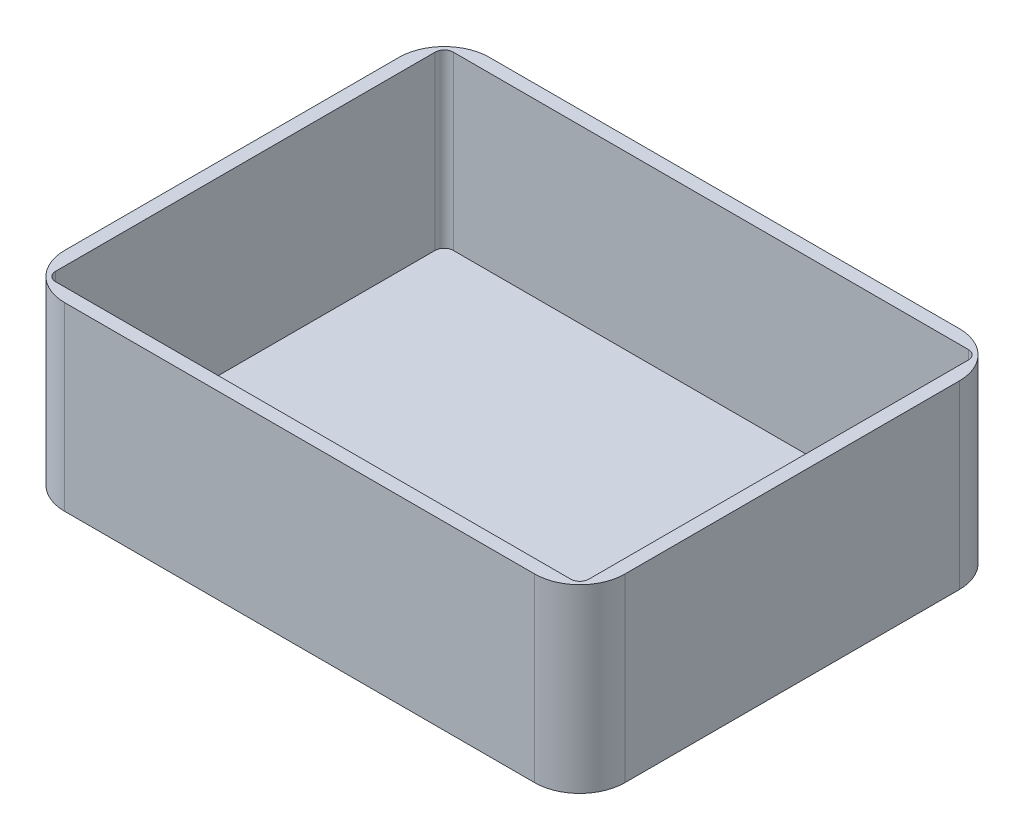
ISO-10303-21;
HEADER;
FILE_DESCRIPTION(('STEP AP214'),'2;1');
FILE_NAME('part.step','',(''),(''),'','','');
FILE_SCHEMA(('AUTOMOTIVE_DESIGN { 1 0 10303 214 1 1 1 1 }'));
ENDSEC;
DATA;
#1=APPLICATION_CONTEXT('core data for automotive mechanical design processes');
#2=APPLICATION_PROTOCOL_DEFINITION('international standard','automotive_design',2000,#1);
#3=PRODUCT_CONTEXT('',#1,'mechanical');
#4=PRODUCT('Part','Part','',(#3));
#5=PRODUCT_RELATED_PRODUCT_CATEGORY('part','',(#4));
#6=PRODUCT_DEFINITION_FORMATION('','',#4);
#7=PRODUCT_DEFINITION_CONTEXT('part definition',#1,'design');
#8=PRODUCT_DEFINITION('design','',#6,#7);
#9=PRODUCT_DEFINITION_SHAPE('','',#8);
#10=(LENGTH_UNIT() NAMED_UNIT(*) SI_UNIT(.MILLI.,.METRE.));
#11=(NAMED_UNIT(*) PLANE_ANGLE_UNIT() SI_UNIT($,.RADIAN.));
#12=(NAMED_UNIT(*) SI_UNIT($,.STERADIAN.) SOLID_ANGLE_UNIT());
#13=UNCERTAINTY_MEASURE_WITH_UNIT(LENGTH_MEASURE(1.E-05),#10,'distance_accuracy_value','');
#14=(GEOMETRIC_REPRESENTATION_CONTEXT(3) GLOBAL_UNCERTAINTY_ASSIGNED_CONTEXT((#13)) GLOBAL_UNIT_ASSIGNED_CONTEXT((#10,
#11,#12)) REPRESENTATION_CONTEXT('',''));
#15=CARTESIAN_POINT('',(0.,0.,0.));
#16=DIRECTION('',(0.,0.,1.));
#17=DIRECTION('',(1.,0.,0.));
#18=AXIS2_PLACEMENT_3D('',#15,#16,#17);
#19=CARTESIAN_POINT('',(62.,40.,-47.));
#20=DIRECTION('',(-1.,0.,0.));
#21=DIRECTION('',(0.,0.,1.));
#22=AXIS2_PLACEMENT_3D('',#19,#20,#21);
#23=PLANE('',#22);
#24=DIRECTION('',(0.,0.,-1.));
#25=VECTOR('',#24,1.);
#26=CARTESIAN_POINT('',(62.,0.,-47.));
#27=LINE('',#26,#25);
#28=CARTESIAN_POINT('',(62.,0.,37.));
#29=VERTEX_POINT('',#28);
#30=CARTESIAN_POINT('',(62.,0.,-37.));
#31=VERTEX_POINT('',#30);
#32=EDGE_CURVE('E182',#29,#31,#27,.T.);
#33=ORIENTED_EDGE('',*,*,#32,.T.);
#34=DIRECTION('',(0.,-1.,0.));
#35=VECTOR('',#34,1.);
#36=CARTESIAN_POINT('',(62.,40.,-37.));
#37=LINE('',#36,#35);
#38=CARTESIAN_POINT('',(62.,40.,-37.));
#39=VERTEX_POINT('',#38);
#40=EDGE_CURVE('E206',#31,#39,#37,.F.);
#41=ORIENTED_EDGE('',*,*,#40,.T.);
#42=DIRECTION('',(0.,0.,-1.));
#43=VECTOR('',#42,1.);
#44=CARTESIAN_POINT('',(62.,40.,-47.));
#45=LINE('',#44,#43);
#46=CARTESIAN_POINT('',(62.,40.,37.));
#47=VERTEX_POINT('',#46);
#48=EDGE_CURVE('E180',#47,#39,#45,.T.);
#49=ORIENTED_EDGE('',*,*,#48,.F.);
#50=DIRECTION('',(0.,-1.,0.));
#51=VECTOR('',#50,1.);
#52=CARTESIAN_POINT('',(62.,40.,37.));
#53=LINE('',#52,#51);
#54=EDGE_CURVE('E203',#47,#29,#53,.T.);
#55=ORIENTED_EDGE('',*,*,#54,.T.);
#56=EDGE_LOOP('',(#33,#41,#49,#55));
#57=FACE_BOUND('',#56,.T.);
#58=ADVANCED_FACE('F38',(#57),#23,.F.);
#59=CARTESIAN_POINT('',(-62.,40.,-47.));
#60=DIRECTION('',(0.,0.,1.));
#61=DIRECTION('',(1.,0.,0.));
#62=AXIS2_PLACEMENT_3D('',#59,#60,#61);
#63=PLANE('',#62);
#64=DIRECTION('',(-1.,0.,0.));
#65=VECTOR('',#64,1.);
#66=CARTESIAN_POINT('',(-62.,0.,-47.));
#67=LINE('',#66,#65);
#68=CARTESIAN_POINT('',(52.,0.,-47.));
#69=VERTEX_POINT('',#68);
#70=CARTESIAN_POINT('',(-52.,0.,-47.));
#71=VERTEX_POINT('',#70);
#72=EDGE_CURVE('E177',#69,#71,#67,.T.);
#73=ORIENTED_EDGE('',*,*,#72,.T.);
#74=DIRECTION('',(0.,-1.,0.));
#75=VECTOR('',#74,1.);
#76=CARTESIAN_POINT('',(-52.,40.,-47.));
#77=LINE('',#76,#75);
#78=CARTESIAN_POINT('',(-52.,40.,-47.));
#79=VERTEX_POINT('',#78);
#80=EDGE_CURVE('E155',#71,#79,#77,.F.);
#81=ORIENTED_EDGE('',*,*,#80,.T.);
#82=DIRECTION('',(-1.,0.,0.));
#83=VECTOR('',#82,1.);
#84=CARTESIAN_POINT('',(-62.,40.,-47.));
#85=LINE('',#84,#83);
#86=CARTESIAN_POINT('',(52.,40.,-47.));
#87=VERTEX_POINT('',#86);
#88=EDGE_CURVE('E285',#87,#79,#85,.T.);
#89=ORIENTED_EDGE('',*,*,#88,.F.);
#90=DIRECTION('',(0.,-1.,0.));
#91=VECTOR('',#90,1.);
#92=CARTESIAN_POINT('',(52.,40.,-47.));
#93=LINE('',#92,#91);
#94=EDGE_CURVE('E160',#87,#69,#93,.T.);
#95=ORIENTED_EDGE('',*,*,#94,.T.);
#96=EDGE_LOOP('',(#73,#81,#89,#95));
#97=FACE_BOUND('',#96,.T.);
#98=ADVANCED_FACE('F302',(#97),#63,.F.);
#99=CARTESIAN_POINT('',(-62.,40.,-47.));
#100=DIRECTION('',(1.,0.,0.));
#101=DIRECTION('',(0.,0.,-1.));
#102=AXIS2_PLACEMENT_3D('',#99,#100,#101);
#103=PLANE('',#102);
#104=DIRECTION('',(0.,0.,1.));
#105=VECTOR('',#104,1.);
#106=CARTESIAN_POINT('',(-62.,40.,-47.));
#107=LINE('',#106,#105);
#108=CARTESIAN_POINT('',(-62.,40.,-37.));
#109=VERTEX_POINT('',#108);
#110=CARTESIAN_POINT('',(-62.,40.,37.));
#111=VERTEX_POINT('',#110);
#112=EDGE_CURVE('E170',#109,#111,#107,.T.);
#113=ORIENTED_EDGE('',*,*,#112,.F.);
#114=DIRECTION('',(0.,-1.,0.));
#115=VECTOR('',#114,1.);
#116=CARTESIAN_POINT('',(-62.,40.,-37.));
#117=LINE('',#116,#115);
#118=CARTESIAN_POINT('',(-62.,0.,-37.));
#119=VERTEX_POINT('',#118);
#120=EDGE_CURVE('E154',#109,#119,#117,.T.);
#121=ORIENTED_EDGE('',*,*,#120,.T.);
#122=DIRECTION('',(0.,0.,1.));
#123=VECTOR('',#122,1.);
#124=CARTESIAN_POINT('',(-62.,0.,-47.));
#125=LINE('',#124,#123);
#126=CARTESIAN_POINT('',(-62.,0.,37.));
#127=VERTEX_POINT('',#126);
#128=EDGE_CURVE('E167',#119,#127,#125,.T.);
#129=ORIENTED_EDGE('',*,*,#128,.T.);
#130=DIRECTION('',(0.,-1.,0.));
#131=VECTOR('',#130,1.);
#132=CARTESIAN_POINT('',(-62.,40.,37.));
#133=LINE('',#132,#131);
#134=EDGE_CURVE('E172',#127,#111,#133,.F.);
#135=ORIENTED_EDGE('',*,*,#134,.T.);
#136=EDGE_LOOP('',(#113,#121,#129,#135));
#137=FACE_BOUND('',#136,.T.);
#138=ADVANCED_FACE('F166',(#137),#103,.F.);
#139=CARTESIAN_POINT('',(-62.,40.,47.));
#140=DIRECTION('',(0.,0.,-1.));
#141=DIRECTION('',(-1.,0.,0.));
#142=AXIS2_PLACEMENT_3D('',#139,#140,#141);
#143=PLANE('',#142);
#144=DIRECTION('',(1.,0.,0.));
#145=VECTOR('',#144,1.);
#146=CARTESIAN_POINT('',(-62.,0.,47.));
#147=LINE('',#146,#145);
#148=CARTESIAN_POINT('',(-52.,0.,47.));
#149=VERTEX_POINT('',#148);
#150=CARTESIAN_POINT('',(52.,0.,47.));
#151=VERTEX_POINT('',#150);
#152=EDGE_CURVE('E176',#149,#151,#147,.T.);
#153=ORIENTED_EDGE('',*,*,#152,.T.);
#154=DIRECTION('',(0.,-1.,0.));
#155=VECTOR('',#154,1.);
#156=CARTESIAN_POINT('',(52.,40.,47.));
#157=LINE('',#156,#155);
#158=CARTESIAN_POINT('',(52.,40.,47.));
#159=VERTEX_POINT('',#158);
#160=EDGE_CURVE('E211',#151,#159,#157,.F.);
#161=ORIENTED_EDGE('',*,*,#160,.T.);
#162=DIRECTION('',(1.,0.,0.));
#163=VECTOR('',#162,1.);
#164=CARTESIAN_POINT('',(-62.,40.,47.));
#165=LINE('',#164,#163);
#166=CARTESIAN_POINT('',(-52.,40.,47.));
#167=VERTEX_POINT('',#166);
#168=EDGE_CURVE('E186',#167,#159,#165,.T.);
#169=ORIENTED_EDGE('',*,*,#168,.F.);
#170=DIRECTION('',(0.,-1.,0.));
#171=VECTOR('',#170,1.);
#172=CARTESIAN_POINT('',(-52.,40.,47.));
#173=LINE('',#172,#171);
#174=EDGE_CURVE('E208',#167,#149,#173,.T.);
#175=ORIENTED_EDGE('',*,*,#174,.T.);
#176=EDGE_LOOP('',(#153,#161,#169,#175));
#177=FACE_BOUND('',#176,.T.);
#178=ADVANCED_FACE('F309',(#177),#143,.F.);
#179=CARTESIAN_POINT('',(0.,40.,0.));
#180=DIRECTION('',(0.,1.,0.));
#181=DIRECTION('',(0.,0.,1.));
#182=AXIS2_PLACEMENT_3D('',#179,#180,#181);
#183=PLANE('',#182);
#184=DIRECTION('',(0.,0.,-1.));
#185=VECTOR('',#184,1.);
#186=CARTESIAN_POINT('',(59.,40.,-44.));
#187=LINE('',#186,#185);
#188=CARTESIAN_POINT('',(59.,40.,42.));
#189=VERTEX_POINT('',#188);
#190=CARTESIAN_POINT('',(59.,40.,-42.));
#191=VERTEX_POINT('',#190);
#192=EDGE_CURVE('E248',#189,#191,#187,.T.);
#193=ORIENTED_EDGE('',*,*,#192,.F.);
#194=CARTESIAN_POINT('',(57.,40.,42.));
#195=DIRECTION('',(0.,1.,0.));
#196=DIRECTION('',(0.,0.,1.));
#197=AXIS2_PLACEMENT_3D('',#194,#195,#196);
#198=CIRCLE('',#197,2.);
#199=CARTESIAN_POINT('',(57.,40.,44.));
#200=VERTEX_POINT('',#199);
#201=EDGE_CURVE('E46',#189,#200,#198,.F.);
#202=ORIENTED_EDGE('',*,*,#201,.T.);
#203=DIRECTION('',(1.,0.,0.));
#204=VECTOR('',#203,1.);
#205=CARTESIAN_POINT('',(-59.,40.,44.));
#206=LINE('',#205,#204);
#207=CARTESIAN_POINT('',(-57.,40.,44.));
#208=VERTEX_POINT('',#207);
#209=EDGE_CURVE('E247',#208,#200,#206,.T.);
#210=ORIENTED_EDGE('',*,*,#209,.F.);
#211=CARTESIAN_POINT('',(-57.,40.,42.));
#212=DIRECTION('',(0.,1.,0.));
#213=DIRECTION('',(0.,0.,1.));
#214=AXIS2_PLACEMENT_3D('',#211,#212,#213);
#215=CIRCLE('',#214,2.);
#216=CARTESIAN_POINT('',(-59.,40.,42.));
#217=VERTEX_POINT('',#216);
#218=EDGE_CURVE('E242',#208,#217,#215,.F.);
#219=ORIENTED_EDGE('',*,*,#218,.T.);
#220=DIRECTION('',(0.,0.,1.));
#221=VECTOR('',#220,1.);
#222=CARTESIAN_POINT('',(-59.,40.,-44.));
#223=LINE('',#222,#221);
#224=CARTESIAN_POINT('',(-59.,40.,-42.));
#225=VERTEX_POINT('',#224);
#226=EDGE_CURVE('E255',#225,#217,#223,.T.);
#227=ORIENTED_EDGE('',*,*,#226,.F.);
#228=CARTESIAN_POINT('',(-57.,40.,-42.));
#229=DIRECTION('',(0.,1.,0.));
#230=DIRECTION('',(0.,0.,1.));
#231=AXIS2_PLACEMENT_3D('',#228,#229,#230);
#232=CIRCLE('',#231,2.);
#233=CARTESIAN_POINT('',(-57.,40.,-44.));
#234=VERTEX_POINT('',#233);
#235=EDGE_CURVE('E240',#225,#234,#232,.F.);
#236=ORIENTED_EDGE('',*,*,#235,.T.);
#237=DIRECTION('',(-1.,0.,0.));
#238=VECTOR('',#237,1.);
#239=CARTESIAN_POINT('',(-59.,40.,-44.));
#240=LINE('',#239,#238);
#241=CARTESIAN_POINT('',(57.,40.,-44.));
#242=VERTEX_POINT('',#241);
#243=EDGE_CURVE('E278',#242,#234,#240,.T.);
#244=ORIENTED_EDGE('',*,*,#243,.F.);
#245=CARTESIAN_POINT('',(57.,40.,-42.));
#246=DIRECTION('',(0.,1.,0.));
#247=DIRECTION('',(0.,0.,1.));
#248=AXIS2_PLACEMENT_3D('',#245,#246,#247);
#249=CIRCLE('',#248,2.);
#250=EDGE_CURVE('E11',#242,#191,#249,.F.);
#251=ORIENTED_EDGE('',*,*,#250,.T.);
#252=EDGE_LOOP('',(#193,#202,#210,#219,#227,#236,#244,#251));
#253=FACE_BOUND('',#252,.T.);
#254=ORIENTED_EDGE('',*,*,#88,.T.);
#255=CARTESIAN_POINT('',(-52.,40.,-37.));
#256=DIRECTION('',(0.,1.,0.));
#257=DIRECTION('',(0.,0.,1.));
#258=AXIS2_PLACEMENT_3D('',#255,#256,#257);
#259=CIRCLE('',#258,10.);
#260=EDGE_CURVE('E201',#79,#109,#259,.T.);
#261=ORIENTED_EDGE('',*,*,#260,.T.);
#262=ORIENTED_EDGE('',*,*,#112,.T.);
#263=CARTESIAN_POINT('',(-52.,40.,37.));
#264=DIRECTION('',(0.,1.,0.));
#265=DIRECTION('',(0.,0.,1.));
#266=AXIS2_PLACEMENT_3D('',#263,#264,#265);
#267=CIRCLE('',#266,10.);
#268=EDGE_CURVE('E195',#111,#167,#267,.T.);
#269=ORIENTED_EDGE('',*,*,#268,.T.);
#270=ORIENTED_EDGE('',*,*,#168,.T.);
#271=CARTESIAN_POINT('',(52.,40.,37.));
#272=DIRECTION('',(0.,1.,0.));
#273=DIRECTION('',(0.,0.,1.));
#274=AXIS2_PLACEMENT_3D('',#271,#272,#273);
#275=CIRCLE('',#274,10.);
#276=EDGE_CURVE('E197',#159,#47,#275,.T.);
#277=ORIENTED_EDGE('',*,*,#276,.T.);
#278=ORIENTED_EDGE('',*,*,#48,.T.);
#279=CARTESIAN_POINT('',(52.,40.,-37.));
#280=DIRECTION('',(0.,1.,0.));
#281=DIRECTION('',(0.,0.,1.));
#282=AXIS2_PLACEMENT_3D('',#279,#280,#281);
#283=CIRCLE('',#282,10.);
#284=EDGE_CURVE('E199',#39,#87,#283,.T.);
#285=ORIENTED_EDGE('',*,*,#284,.T.);
#286=EDGE_LOOP('',(#254,#261,#262,#269,#270,#277,#278,#285));
#287=FACE_BOUND('',#286,.T.);
#288=ADVANCED_FACE('F245',(#253,#287),#183,.T.);
#289=CARTESIAN_POINT('',(0.,0.,0.));
#290=DIRECTION('',(0.,1.,0.));
#291=DIRECTION('',(0.,0.,1.));
#292=AXIS2_PLACEMENT_3D('',#289,#290,#291);
#293=PLANE('',#292);
#294=ORIENTED_EDGE('',*,*,#128,.F.);
#295=CARTESIAN_POINT('',(-52.,0.,-37.));
#296=DIRECTION('',(0.,1.,0.));
#297=DIRECTION('',(0.,0.,1.));
#298=AXIS2_PLACEMENT_3D('',#295,#296,#297);
#299=CIRCLE('',#298,10.);
#300=EDGE_CURVE('E150',#119,#71,#299,.F.);
#301=ORIENTED_EDGE('',*,*,#300,.T.);
#302=ORIENTED_EDGE('',*,*,#72,.F.);
#303=CARTESIAN_POINT('',(52.,0.,-37.));
#304=DIRECTION('',(0.,1.,0.));
#305=DIRECTION('',(0.,0.,1.));
#306=AXIS2_PLACEMENT_3D('',#303,#304,#305);
#307=CIRCLE('',#306,10.);
#308=EDGE_CURVE('E161',#69,#31,#307,.F.);
#309=ORIENTED_EDGE('',*,*,#308,.T.);
#310=ORIENTED_EDGE('',*,*,#32,.F.);
#311=CARTESIAN_POINT('',(52.,0.,37.));
#312=DIRECTION('',(0.,1.,0.));
#313=DIRECTION('',(0.,0.,1.));
#314=AXIS2_PLACEMENT_3D('',#311,#312,#313);
#315=CIRCLE('',#314,10.);
#316=EDGE_CURVE('E189',#29,#151,#315,.F.);
#317=ORIENTED_EDGE('',*,*,#316,.T.);
#318=ORIENTED_EDGE('',*,*,#152,.F.);
#319=CARTESIAN_POINT('',(-52.,0.,37.));
#320=DIRECTION('',(0.,1.,0.));
#321=DIRECTION('',(0.,0.,1.));
#322=AXIS2_PLACEMENT_3D('',#319,#320,#321);
#323=CIRCLE('',#322,10.);
#324=EDGE_CURVE('E171',#149,#127,#323,.F.);
#325=ORIENTED_EDGE('',*,*,#324,.T.);
#326=EDGE_LOOP('',(#294,#301,#302,#309,#310,#317,#318,#325));
#327=FACE_BOUND('',#326,.T.);
#328=ADVANCED_FACE('F174',(#327),#293,.F.);
#329=CARTESIAN_POINT('',(59.,2.,-44.));
#330=DIRECTION('',(1.,0.,0.));
#331=DIRECTION('',(0.,0.,-1.));
#332=AXIS2_PLACEMENT_3D('',#329,#330,#331);
#333=PLANE('',#332);
#334=DIRECTION('',(0.,0.,-1.));
#335=VECTOR('',#334,1.);
#336=CARTESIAN_POINT('',(59.,2.,-44.));
#337=LINE('',#336,#335);
#338=CARTESIAN_POINT('',(59.,2.,42.));
#339=VERTEX_POINT('',#338);
#340=CARTESIAN_POINT('',(59.,2.,-42.));
#341=VERTEX_POINT('',#340);
#342=EDGE_CURVE('E254',#339,#341,#337,.T.);
#343=ORIENTED_EDGE('',*,*,#342,.F.);
#344=DIRECTION('',(0.,1.,0.));
#345=VECTOR('',#344,1.);
#346=CARTESIAN_POINT('',(59.,40.,42.));
#347=LINE('',#346,#345);
#348=EDGE_CURVE('E238',#339,#189,#347,.T.);
#349=ORIENTED_EDGE('',*,*,#348,.T.);
#350=ORIENTED_EDGE('',*,*,#192,.T.);
#351=DIRECTION('',(0.,1.,0.));
#352=VECTOR('',#351,1.);
#353=CARTESIAN_POINT('',(59.,2.,-42.));
#354=LINE('',#353,#352);
#355=EDGE_CURVE('E236',#191,#341,#354,.F.);
#356=ORIENTED_EDGE('',*,*,#355,.T.);
#357=EDGE_LOOP('',(#343,#349,#350,#356));
#358=FACE_BOUND('',#357,.T.);
#359=ADVANCED_FACE('F267',(#358),#333,.F.);
#360=CARTESIAN_POINT('',(-59.,2.,44.));
#361=DIRECTION('',(0.,0.,1.));
#362=DIRECTION('',(1.,0.,0.));
#363=AXIS2_PLACEMENT_3D('',#360,#361,#362);
#364=PLANE('',#363);
#365=DIRECTION('',(1.,0.,0.));
#366=VECTOR('',#365,1.);
#367=CARTESIAN_POINT('',(-59.,2.,44.));
#368=LINE('',#367,#366);
#369=CARTESIAN_POINT('',(-57.,2.,44.));
#370=VERTEX_POINT('',#369);
#371=CARTESIAN_POINT('',(57.,2.,44.));
#372=VERTEX_POINT('',#371);
#373=EDGE_CURVE('E265',#370,#372,#368,.T.);
#374=ORIENTED_EDGE('',*,*,#373,.F.);
#375=DIRECTION('',(0.,1.,0.));
#376=VECTOR('',#375,1.);
#377=CARTESIAN_POINT('',(-57.,40.,44.));
#378=LINE('',#377,#376);
#379=EDGE_CURVE('E233',#370,#208,#378,.T.);
#380=ORIENTED_EDGE('',*,*,#379,.T.);
#381=ORIENTED_EDGE('',*,*,#209,.T.);
#382=DIRECTION('',(0.,1.,0.));
#383=VECTOR('',#382,1.);
#384=CARTESIAN_POINT('',(57.,2.,44.));
#385=LINE('',#384,#383);
#386=EDGE_CURVE('E231',#200,#372,#385,.F.);
#387=ORIENTED_EDGE('',*,*,#386,.T.);
#388=EDGE_LOOP('',(#374,#380,#381,#387));
#389=FACE_BOUND('',#388,.T.);
#390=ADVANCED_FACE('F251',(#389),#364,.F.);
#391=CARTESIAN_POINT('',(-59.,2.,-44.));
#392=DIRECTION('',(-1.,0.,0.));
#393=DIRECTION('',(0.,0.,1.));
#394=AXIS2_PLACEMENT_3D('',#391,#392,#393);
#395=PLANE('',#394);
#396=DIRECTION('',(0.,0.,1.));
#397=VECTOR('',#396,1.);
#398=CARTESIAN_POINT('',(-59.,2.,-44.));
#399=LINE('',#398,#397);
#400=CARTESIAN_POINT('',(-59.,2.,-42.));
#401=VERTEX_POINT('',#400);
#402=CARTESIAN_POINT('',(-59.,2.,42.));
#403=VERTEX_POINT('',#402);
#404=EDGE_CURVE('E271',#401,#403,#399,.T.);
#405=ORIENTED_EDGE('',*,*,#404,.F.);
#406=DIRECTION('',(0.,1.,0.));
#407=VECTOR('',#406,1.);
#408=CARTESIAN_POINT('',(-59.,40.,-42.));
#409=LINE('',#408,#407);
#410=EDGE_CURVE('E215',#401,#225,#409,.T.);
#411=ORIENTED_EDGE('',*,*,#410,.T.);
#412=ORIENTED_EDGE('',*,*,#226,.T.);
#413=DIRECTION('',(0.,1.,0.));
#414=VECTOR('',#413,1.);
#415=CARTESIAN_POINT('',(-59.,2.,42.));
#416=LINE('',#415,#414);
#417=EDGE_CURVE('E213',#217,#403,#416,.F.);
#418=ORIENTED_EDGE('',*,*,#417,.T.);
#419=EDGE_LOOP('',(#405,#411,#412,#418));
#420=FACE_BOUND('',#419,.T.);
#421=ADVANCED_FACE('F350',(#420),#395,.F.);
#422=CARTESIAN_POINT('',(-59.,2.,-44.));
#423=DIRECTION('',(0.,0.,-1.));
#424=DIRECTION('',(-1.,0.,0.));
#425=AXIS2_PLACEMENT_3D('',#422,#423,#424);
#426=PLANE('',#425);
#427=ORIENTED_EDGE('',*,*,#243,.T.);
#428=DIRECTION('',(0.,1.,0.));
#429=VECTOR('',#428,1.);
#430=CARTESIAN_POINT('',(-57.,2.,-44.));
#431=LINE('',#430,#429);
#432=CARTESIAN_POINT('',(-57.,2.,-44.));
#433=VERTEX_POINT('',#432);
#434=EDGE_CURVE('E221',#234,#433,#431,.F.);
#435=ORIENTED_EDGE('',*,*,#434,.T.);
#436=DIRECTION('',(-1.,0.,0.));
#437=VECTOR('',#436,1.);
#438=CARTESIAN_POINT('',(-59.,2.,-44.));
#439=LINE('',#438,#437);
#440=CARTESIAN_POINT('',(57.,2.,-44.));
#441=VERTEX_POINT('',#440);
#442=EDGE_CURVE('E269',#441,#433,#439,.T.);
#443=ORIENTED_EDGE('',*,*,#442,.F.);
#444=DIRECTION('',(0.,1.,0.));
#445=VECTOR('',#444,1.);
#446=CARTESIAN_POINT('',(57.,40.,-44.));
#447=LINE('',#446,#445);
#448=EDGE_CURVE('E218',#441,#242,#447,.T.);
#449=ORIENTED_EDGE('',*,*,#448,.T.);
#450=EDGE_LOOP('',(#427,#435,#443,#449));
#451=FACE_BOUND('',#450,.T.);
#452=ADVANCED_FACE('F344',(#451),#426,.F.);
#453=CARTESIAN_POINT('',(0.,2.,0.));
#454=DIRECTION('',(0.,1.,0.));
#455=DIRECTION('',(0.,0.,1.));
#456=AXIS2_PLACEMENT_3D('',#453,#454,#455);
#457=PLANE('',#456);
#458=ORIENTED_EDGE('',*,*,#442,.T.);
#459=CARTESIAN_POINT('',(-57.,2.,-42.));
#460=DIRECTION('',(0.,1.,0.));
#461=DIRECTION('',(0.,0.,1.));
#462=AXIS2_PLACEMENT_3D('',#459,#460,#461);
#463=CIRCLE('',#462,2.);
#464=EDGE_CURVE('E229',#433,#401,#463,.T.);
#465=ORIENTED_EDGE('',*,*,#464,.T.);
#466=ORIENTED_EDGE('',*,*,#404,.T.);
#467=CARTESIAN_POINT('',(-57.,2.,42.));
#468=DIRECTION('',(0.,1.,0.));
#469=DIRECTION('',(0.,0.,1.));
#470=AXIS2_PLACEMENT_3D('',#467,#468,#469);
#471=CIRCLE('',#470,2.);
#472=EDGE_CURVE('E227',#403,#370,#471,.T.);
#473=ORIENTED_EDGE('',*,*,#472,.T.);
#474=ORIENTED_EDGE('',*,*,#373,.T.);
#475=CARTESIAN_POINT('',(57.,2.,42.));
#476=DIRECTION('',(0.,1.,0.));
#477=DIRECTION('',(0.,0.,1.));
#478=AXIS2_PLACEMENT_3D('',#475,#476,#477);
#479=CIRCLE('',#478,2.);
#480=EDGE_CURVE('E225',#372,#339,#479,.T.);
#481=ORIENTED_EDGE('',*,*,#480,.T.);
#482=ORIENTED_EDGE('',*,*,#342,.T.);
#483=CARTESIAN_POINT('',(57.,2.,-42.));
#484=DIRECTION('',(0.,1.,0.));
#485=DIRECTION('',(0.,0.,1.));
#486=AXIS2_PLACEMENT_3D('',#483,#484,#485);
#487=CIRCLE('',#486,2.);
#488=EDGE_CURVE('E223',#341,#441,#487,.T.);
#489=ORIENTED_EDGE('',*,*,#488,.T.);
#490=EDGE_LOOP('',(#458,#465,#466,#473,#474,#481,#482,#489));
#491=FACE_BOUND('',#490,.T.);
#492=ADVANCED_FACE('F263',(#491),#457,.T.);
#493=CARTESIAN_POINT('',(-52.,40.,-37.));
#494=DIRECTION('',(0.,-1.,0.));
#495=DIRECTION('',(0.,0.,-1.));
#496=AXIS2_PLACEMENT_3D('',#493,#494,#495);
#497=CYLINDRICAL_SURFACE('',#496,10.);
#498=ORIENTED_EDGE('',*,*,#260,.F.);
#499=ORIENTED_EDGE('',*,*,#80,.F.);
#500=ORIENTED_EDGE('',*,*,#300,.F.);
#501=ORIENTED_EDGE('',*,*,#120,.F.);
#502=EDGE_LOOP('',(#498,#499,#500,#501));
#503=FACE_BOUND('',#502,.T.);
#504=ADVANCED_FACE('F153',(#503),#497,.T.);
#505=CARTESIAN_POINT('',(52.,40.,-37.));
#506=DIRECTION('',(0.,-1.,0.));
#507=DIRECTION('',(0.,0.,-1.));
#508=AXIS2_PLACEMENT_3D('',#505,#506,#507);
#509=CYLINDRICAL_SURFACE('',#508,10.);
#510=ORIENTED_EDGE('',*,*,#284,.F.);
#511=ORIENTED_EDGE('',*,*,#40,.F.);
#512=ORIENTED_EDGE('',*,*,#308,.F.);
#513=ORIENTED_EDGE('',*,*,#94,.F.);
#514=EDGE_LOOP('',(#510,#511,#512,#513));
#515=FACE_BOUND('',#514,.T.);
#516=ADVANCED_FACE('F298',(#515),#509,.T.);
#517=CARTESIAN_POINT('',(52.,40.,37.));
#518=DIRECTION('',(0.,-1.,0.));
#519=DIRECTION('',(0.,0.,-1.));
#520=AXIS2_PLACEMENT_3D('',#517,#518,#519);
#521=CYLINDRICAL_SURFACE('',#520,10.);
#522=ORIENTED_EDGE('',*,*,#276,.F.);
#523=ORIENTED_EDGE('',*,*,#160,.F.);
#524=ORIENTED_EDGE('',*,*,#316,.F.);
#525=ORIENTED_EDGE('',*,*,#54,.F.);
#526=EDGE_LOOP('',(#522,#523,#524,#525));
#527=FACE_BOUND('',#526,.T.);
#528=ADVANCED_FACE('F318',(#527),#521,.T.);
#529=CARTESIAN_POINT('',(-52.,40.,37.));
#530=DIRECTION('',(0.,-1.,0.));
#531=DIRECTION('',(0.,0.,-1.));
#532=AXIS2_PLACEMENT_3D('',#529,#530,#531);
#533=CYLINDRICAL_SURFACE('',#532,10.);
#534=ORIENTED_EDGE('',*,*,#268,.F.);
#535=ORIENTED_EDGE('',*,*,#134,.F.);
#536=ORIENTED_EDGE('',*,*,#324,.F.);
#537=ORIENTED_EDGE('',*,*,#174,.F.);
#538=EDGE_LOOP('',(#534,#535,#536,#537));
#539=FACE_BOUND('',#538,.T.);
#540=ADVANCED_FACE('F321',(#539),#533,.T.);
#541=CARTESIAN_POINT('',(-57.,2.,-42.));
#542=DIRECTION('',(0.,-1.,0.));
#543=DIRECTION('',(0.,0.,-1.));
#544=AXIS2_PLACEMENT_3D('',#541,#542,#543);
#545=CYLINDRICAL_SURFACE('',#544,2.);
#546=ORIENTED_EDGE('',*,*,#464,.F.);
#547=ORIENTED_EDGE('',*,*,#434,.F.);
#548=ORIENTED_EDGE('',*,*,#235,.F.);
#549=ORIENTED_EDGE('',*,*,#410,.F.);
#550=EDGE_LOOP('',(#546,#547,#548,#549));
#551=FACE_BOUND('',#550,.T.);
#552=ADVANCED_FACE('F325',(#551),#545,.F.);
#553=CARTESIAN_POINT('',(-57.,2.,42.));
#554=DIRECTION('',(0.,-1.,0.));
#555=DIRECTION('',(0.,0.,-1.));
#556=AXIS2_PLACEMENT_3D('',#553,#554,#555);
#557=CYLINDRICAL_SURFACE('',#556,2.);
#558=ORIENTED_EDGE('',*,*,#472,.F.);
#559=ORIENTED_EDGE('',*,*,#417,.F.);
#560=ORIENTED_EDGE('',*,*,#218,.F.);
#561=ORIENTED_EDGE('',*,*,#379,.F.);
#562=EDGE_LOOP('',(#558,#559,#560,#561));
#563=FACE_BOUND('',#562,.T.);
#564=ADVANCED_FACE('F329',(#563),#557,.F.);
#565=CARTESIAN_POINT('',(57.,2.,42.));
#566=DIRECTION('',(0.,-1.,0.));
#567=DIRECTION('',(0.,0.,-1.));
#568=AXIS2_PLACEMENT_3D('',#565,#566,#567);
#569=CYLINDRICAL_SURFACE('',#568,2.);
#570=ORIENTED_EDGE('',*,*,#480,.F.);
#571=ORIENTED_EDGE('',*,*,#386,.F.);
#572=ORIENTED_EDGE('',*,*,#201,.F.);
#573=ORIENTED_EDGE('',*,*,#348,.F.);
#574=EDGE_LOOP('',(#570,#571,#572,#573));
#575=FACE_BOUND('',#574,.T.);
#576=ADVANCED_FACE('F258',(#575),#569,.F.);
#577=CARTESIAN_POINT('',(57.,2.,-42.));
#578=DIRECTION('',(0.,-1.,0.));
#579=DIRECTION('',(0.,0.,-1.));
#580=AXIS2_PLACEMENT_3D('',#577,#578,#579);
#581=CYLINDRICAL_SURFACE('',#580,2.);
#582=ORIENTED_EDGE('',*,*,#488,.F.);
#583=ORIENTED_EDGE('',*,*,#355,.F.);
#584=ORIENTED_EDGE('',*,*,#250,.F.);
#585=ORIENTED_EDGE('',*,*,#448,.F.);
#586=EDGE_LOOP('',(#582,#583,#584,#585));
#587=FACE_BOUND('',#586,.T.);
#588=ADVANCED_FACE('F40',(#587),#581,.F.);
#589=CLOSED_SHELL('',(#58,#98,#138,#178,#288,#328,#359,#390,#421,#452,#492,#504,#516,#528,#540,
#552,#564,#576,#588));
#590=MANIFOLD_SOLID_BREP('B2',#589);
#591=ADVANCED_BREP_SHAPE_REPRESENTATION('',(#18,#590),#14);
#592=SHAPE_DEFINITION_REPRESENTATION(#9,#591);
ENDSEC;
END-ISO-10303-21;
